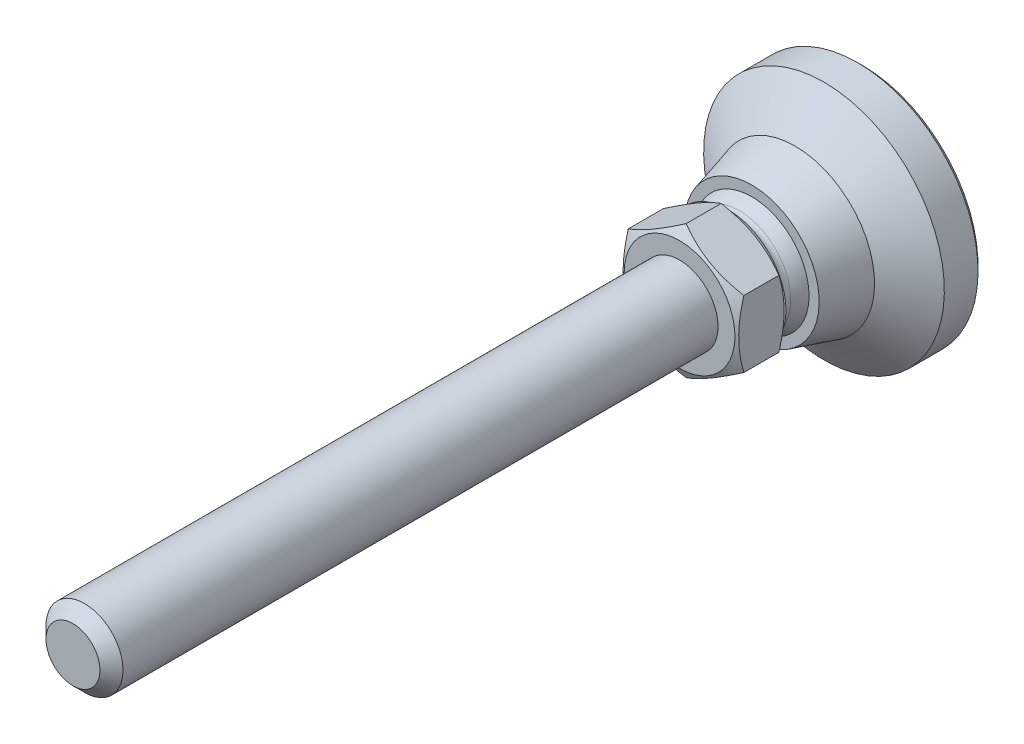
ISO-10303-21;
HEADER;
FILE_DESCRIPTION(('STEP AP214'),'2;1');
FILE_NAME('part.step','',(''),(''),'','','');
FILE_SCHEMA(('AUTOMOTIVE_DESIGN { 1 0 10303 214 1 1 1 1 }'));
ENDSEC;
DATA;
#1=APPLICATION_CONTEXT('core data for automotive mechanical design processes');
#2=APPLICATION_PROTOCOL_DEFINITION('international standard','automotive_design',2000,#1);
#3=PRODUCT_CONTEXT('',#1,'mechanical');
#4=PRODUCT('Part','Part','',(#3));
#5=PRODUCT_RELATED_PRODUCT_CATEGORY('part','',(#4));
#6=PRODUCT_DEFINITION_FORMATION('','',#4);
#7=PRODUCT_DEFINITION_CONTEXT('part definition',#1,'design');
#8=PRODUCT_DEFINITION('design','',#6,#7);
#9=PRODUCT_DEFINITION_SHAPE('','',#8);
#10=(LENGTH_UNIT() NAMED_UNIT(*) SI_UNIT(.MILLI.,.METRE.));
#11=(NAMED_UNIT(*) PLANE_ANGLE_UNIT() SI_UNIT($,.RADIAN.));
#12=(NAMED_UNIT(*) SI_UNIT($,.STERADIAN.) SOLID_ANGLE_UNIT());
#13=UNCERTAINTY_MEASURE_WITH_UNIT(LENGTH_MEASURE(1.E-05),#10,'distance_accuracy_value','');
#14=(GEOMETRIC_REPRESENTATION_CONTEXT(3) GLOBAL_UNCERTAINTY_ASSIGNED_CONTEXT((#13)) GLOBAL_UNIT_ASSIGNED_CONTEXT((#10,
#11,#12)) REPRESENTATION_CONTEXT('',''));
#15=CARTESIAN_POINT('',(0.,0.,0.));
#16=DIRECTION('',(0.,0.,1.));
#17=DIRECTION('',(1.,0.,0.));
#18=AXIS2_PLACEMENT_3D('',#15,#16,#17);
#19=CARTESIAN_POINT('',(0.,0.,0.5));
#20=DIRECTION('',(0.,0.,1.));
#21=DIRECTION('',(0.,-1.,0.));
#22=AXIS2_PLACEMENT_3D('',#19,#20,#21);
#23=CONICAL_SURFACE('',#22,12.5,0.785398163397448);
#24=CARTESIAN_POINT('',(0.,0.,0.));
#25=DIRECTION('',(0.,0.,-1.));
#26=DIRECTION('',(0.,1.,0.));
#27=AXIS2_PLACEMENT_3D('',#24,#25,#26);
#28=CIRCLE('',#27,12.);
#29=CARTESIAN_POINT('',(0.,12.,0.));
#30=VERTEX_POINT('',#29);
#31=EDGE_CURVE('E109',#30,#30,#28,.T.);
#32=ORIENTED_EDGE('',*,*,#31,.F.);
#33=EDGE_LOOP('',(#32));
#34=FACE_BOUND('',#33,.T.);
#35=CARTESIAN_POINT('',(0.,0.,0.5));
#36=DIRECTION('',(0.,0.,-1.));
#37=DIRECTION('',(0.,1.,0.));
#38=AXIS2_PLACEMENT_3D('',#35,#36,#37);
#39=CIRCLE('',#38,12.5);
#40=CARTESIAN_POINT('',(0.,12.5,0.5));
#41=VERTEX_POINT('',#40);
#42=EDGE_CURVE('E144',#41,#41,#39,.T.);
#43=ORIENTED_EDGE('',*,*,#42,.T.);
#44=EDGE_LOOP('',(#43));
#45=FACE_BOUND('',#44,.T.);
#46=ADVANCED_FACE('F14',(#34,#45),#23,.T.);
#47=CARTESIAN_POINT('',(0.,0.,0.));
#48=DIRECTION('',(0.,0.,1.));
#49=DIRECTION('',(0.,-1.,0.));
#50=AXIS2_PLACEMENT_3D('',#47,#48,#49);
#51=PLANE('',#50);
#52=ORIENTED_EDGE('',*,*,#31,.T.);
#53=EDGE_LOOP('',(#52));
#54=FACE_BOUND('',#53,.T.);
#55=ADVANCED_FACE('F283',(#54),#51,.F.);
#56=CARTESIAN_POINT('',(0.,0.,13.1997728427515));
#57=DIRECTION('',(0.,0.,-1.));
#58=DIRECTION('',(0.,1.,0.));
#59=AXIS2_PLACEMENT_3D('',#56,#57,#58);
#60=TOROIDAL_SURFACE('',#59,6.05010572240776,0.800227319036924);
#61=CARTESIAN_POINT('',(0.,0.,12.8053528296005));
#62=DIRECTION('',(0.,0.,-1.));
#63=DIRECTION('',(0.,1.,0.));
#64=AXIS2_PLACEMENT_3D('',#61,#62,#63);
#65=CIRCLE('',#64,5.35383234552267);
#66=CARTESIAN_POINT('',(-5.3538323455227,0.,12.8053528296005));
#67=VERTEX_POINT('',#66);
#68=EDGE_CURVE('E160',#67,#67,#65,.T.);
#69=ORIENTED_EDGE('',*,*,#68,.F.);
#70=EDGE_LOOP('',(#69));
#71=FACE_BOUND('',#70,.T.);
#72=CARTESIAN_POINT('',(2.32740595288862,5.58441436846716,14.0000001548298));
#73=CARTESIAN_POINT('',(2.38730882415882,5.55944918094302,14.0000001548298));
#74=CARTESIAN_POINT('',(2.44680968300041,5.53351945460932,14.0000001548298));
#75=CARTESIAN_POINT('',(2.56494646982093,5.47975932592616,14.0000001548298));
#76=CARTESIAN_POINT('',(2.62358239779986,5.45192892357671,14.0000001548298));
#77=CARTESIAN_POINT('',(2.73992841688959,5.39439584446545,14.0000001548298));
#78=CARTESIAN_POINT('',(2.79763850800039,5.36469316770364,14.0000001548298));
#79=CARTESIAN_POINT('',(2.91207314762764,5.30344640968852,14.0000001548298));
#80=CARTESIAN_POINT('',(2.96879769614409,5.2719023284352,14.0000001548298));
#81=CARTESIAN_POINT('',(3.08120249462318,5.20700538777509,14.0000001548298));
#82=CARTESIAN_POINT('',(3.13688274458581,5.1736525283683,14.0000001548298));
#83=CARTESIAN_POINT('',(3.24714131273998,5.10517260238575,14.0000001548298));
#84=CARTESIAN_POINT('',(3.3017196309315,5.07004553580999,14.0000001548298));
#85=CARTESIAN_POINT('',(3.40971774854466,4.99805346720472,14.0000001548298));
#86=CARTESIAN_POINT('',(3.46313754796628,4.96118846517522,14.0000001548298));
#87=CARTESIAN_POINT('',(3.56876357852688,4.88575907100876,14.0000001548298));
#88=CARTESIAN_POINT('',(3.62096980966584,4.8471946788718,14.0000001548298));
#89=CARTESIAN_POINT('',(3.67254173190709,4.80779986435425,14.0000001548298));
#90=B_SPLINE_CURVE_WITH_KNOTS('',3,(#72,#73,#74,#75,#76,#77,#78,#79,#80,#81,#82,#83,#84,#85,#86,
#87,#88,#89),.UNSPECIFIED.,.F.,.F.,(4,2,2,2,2,2,2,2,4),(0.,0.194682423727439,0.389364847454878,
0.584047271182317,0.778729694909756,0.973412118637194,1.16809454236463,1.36277696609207,
1.55745938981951),.UNSPECIFIED.);
#91=CARTESIAN_POINT('',(2.32724464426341,5.58455280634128,14.0000001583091));
#92=VERTEX_POINT('',#91);
#93=CARTESIAN_POINT('',(3.67274227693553,4.80772938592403,14.0000001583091));
#94=VERTEX_POINT('',#93);
#95=EDGE_CURVE('E166',#92,#94,#90,.T.);
#96=ORIENTED_EDGE('',*,*,#95,.T.);
#97=CARTESIAN_POINT('',(0.,0.,14.0000001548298));
#98=DIRECTION('',(0.,0.,-1.));
#99=DIRECTION('',(0.,1.,0.));
#100=AXIS2_PLACEMENT_3D('',#97,#98,#99);
#101=CIRCLE('',#100,6.05000019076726);
#102=CARTESIAN_POINT('',(5.99998692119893,0.776823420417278,14.0000001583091));
#103=VERTEX_POINT('',#102);
#104=EDGE_CURVE('E169',#94,#103,#101,.T.);
#105=ORIENTED_EDGE('',*,*,#104,.T.);
#106=CARTESIAN_POINT('',(5.9999476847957,0.776614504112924,14.0000001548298));
#107=CARTESIAN_POINT('',(6.00827863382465,0.712254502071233,14.0000001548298));
#108=CARTESIAN_POINT('',(6.01557326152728,0.647760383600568,14.0000001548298));
#109=CARTESIAN_POINT('',(6.02808401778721,0.51857086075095,14.0000001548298));
#110=CARTESIAN_POINT('',(6.03330014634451,0.453875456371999,14.0000001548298));
#111=CARTESIAN_POINT('',(6.04164804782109,0.324350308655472,14.0000001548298));
#112=CARTESIAN_POINT('',(6.04477982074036,0.259520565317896,14.0000001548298));
#113=CARTESIAN_POINT('',(6.04895589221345,0.129793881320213,14.0000001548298));
#114=CARTESIAN_POINT('',(6.05000019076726,0.0648969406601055,14.0000001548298));
#115=CARTESIAN_POINT('',(6.05000019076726,-0.0648969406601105,14.0000001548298));
#116=CARTESIAN_POINT('',(6.04895589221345,-0.129793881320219,14.0000001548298));
#117=CARTESIAN_POINT('',(6.04477982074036,-0.259520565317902,14.0000001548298));
#118=CARTESIAN_POINT('',(6.04164804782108,-0.324350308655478,14.0000001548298));
#119=CARTESIAN_POINT('',(6.03330014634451,-0.453875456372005,14.0000001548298));
#120=CARTESIAN_POINT('',(6.02808401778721,-0.518570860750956,14.0000001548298));
#121=CARTESIAN_POINT('',(6.01557326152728,-0.647760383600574,14.0000001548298));
#122=CARTESIAN_POINT('',(6.00827863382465,-0.712254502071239,14.0000001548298));
#123=CARTESIAN_POINT('',(5.9999476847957,-0.77661450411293,14.0000001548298));
#124=B_SPLINE_CURVE_WITH_KNOTS('',3,(#106,#107,#108,#109,#110,#111,#112,#113,#114,#115,#116,
#117,#118,#119,#120,#121,#122,#123),.UNSPECIFIED.,.F.,.F.,(4,2,2,2,2,2,2,2,4),(0.,
0.194682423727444,0.389364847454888,0.584047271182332,0.778729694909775,0.97341211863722,
1.16809454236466,1.36277696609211,1.55745938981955),.UNSPECIFIED.);
#125=CARTESIAN_POINT('',(5.99998692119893,-0.776823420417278,14.0000001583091));
#126=VERTEX_POINT('',#125);
#127=EDGE_CURVE('E615',#103,#126,#124,.T.);
#128=ORIENTED_EDGE('',*,*,#127,.T.);
#129=CARTESIAN_POINT('',(3.67274227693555,-4.80772938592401,14.0000001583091));
#130=VERTEX_POINT('',#129);
#131=EDGE_CURVE('E179',#126,#130,#101,.T.);
#132=ORIENTED_EDGE('',*,*,#131,.T.);
#133=CARTESIAN_POINT('',(3.67254173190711,-4.80779986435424,14.0000001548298));
#134=CARTESIAN_POINT('',(3.62096980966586,-4.84719467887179,14.0000001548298));
#135=CARTESIAN_POINT('',(3.56876357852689,-4.88575907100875,14.0000001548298));
#136=CARTESIAN_POINT('',(3.4631375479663,-4.96118846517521,14.0000001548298));
#137=CARTESIAN_POINT('',(3.40971774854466,-4.99805346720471,14.0000001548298));
#138=CARTESIAN_POINT('',(3.30171963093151,-5.07004553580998,14.0000001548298));
#139=CARTESIAN_POINT('',(3.24714131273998,-5.10517260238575,14.0000001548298));
#140=CARTESIAN_POINT('',(3.13688274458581,-5.1736525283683,14.0000001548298));
#141=CARTESIAN_POINT('',(3.08120249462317,-5.2070053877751,14.0000001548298));
#142=CARTESIAN_POINT('',(2.96879769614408,-5.2719023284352,14.0000001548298));
#143=CARTESIAN_POINT('',(2.91207314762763,-5.30344640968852,14.0000001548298));
#144=CARTESIAN_POINT('',(2.79763850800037,-5.36469316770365,14.0000001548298));
#145=CARTESIAN_POINT('',(2.73992841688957,-5.39439584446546,14.0000001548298));
#146=CARTESIAN_POINT('',(2.62358239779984,-5.45192892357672,14.0000001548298));
#147=CARTESIAN_POINT('',(2.56494646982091,-5.47975932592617,14.0000001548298));
#148=CARTESIAN_POINT('',(2.44680968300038,-5.53351945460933,14.0000001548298));
#149=CARTESIAN_POINT('',(2.38730882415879,-5.55944918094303,14.0000001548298));
#150=CARTESIAN_POINT('',(2.32740595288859,-5.58441436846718,14.0000001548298));
#151=B_SPLINE_CURVE_WITH_KNOTS('',3,(#133,#134,#135,#136,#137,#138,#139,#140,#141,#142,#143,
#144,#145,#146,#147,#148,#149,#150),.UNSPECIFIED.,.F.,.F.,(4,2,2,2,2,2,2,2,4),(0.,
0.194682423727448,0.389364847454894,0.58404727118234,0.778729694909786,0.973412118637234,
1.16809454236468,1.36277696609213,1.55745938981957),.UNSPECIFIED.);
#152=CARTESIAN_POINT('',(2.32724464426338,-5.58455280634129,14.0000001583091));
#153=VERTEX_POINT('',#152);
#154=EDGE_CURVE('E263',#130,#153,#151,.T.);
#155=ORIENTED_EDGE('',*,*,#154,.T.);
#156=CARTESIAN_POINT('',(-2.32724464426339,-5.58455280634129,14.0000001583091));
#157=VERTEX_POINT('',#156);
#158=EDGE_CURVE('E181',#153,#157,#101,.T.);
#159=ORIENTED_EDGE('',*,*,#158,.T.);
#160=CARTESIAN_POINT('',(-2.32740595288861,-5.58441436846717,14.0000001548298));
#161=CARTESIAN_POINT('',(-2.38730882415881,-5.55944918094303,14.0000001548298));
#162=CARTESIAN_POINT('',(-2.4468096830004,-5.53351945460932,14.0000001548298));
#163=CARTESIAN_POINT('',(-2.56494646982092,-5.47975932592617,14.0000001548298));
#164=CARTESIAN_POINT('',(-2.62358239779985,-5.45192892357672,14.0000001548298));
#165=CARTESIAN_POINT('',(-2.73992841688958,-5.39439584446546,14.0000001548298));
#166=CARTESIAN_POINT('',(-2.79763850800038,-5.36469316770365,14.0000001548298));
#167=CARTESIAN_POINT('',(-2.91207314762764,-5.30344640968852,14.0000001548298));
#168=CARTESIAN_POINT('',(-2.96879769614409,-5.2719023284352,14.0000001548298));
#169=CARTESIAN_POINT('',(-3.08120249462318,-5.20700538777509,14.0000001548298));
#170=CARTESIAN_POINT('',(-3.13688274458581,-5.1736525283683,14.0000001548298));
#171=CARTESIAN_POINT('',(-3.24714131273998,-5.10517260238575,14.0000001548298));
#172=CARTESIAN_POINT('',(-3.30171963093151,-5.07004553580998,14.0000001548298));
#173=CARTESIAN_POINT('',(-3.40971774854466,-4.99805346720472,14.0000001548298));
#174=CARTESIAN_POINT('',(-3.46313754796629,-4.96118846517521,14.0000001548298));
#175=CARTESIAN_POINT('',(-3.56876357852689,-4.88575907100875,14.0000001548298));
#176=CARTESIAN_POINT('',(-3.62096980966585,-4.84719467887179,14.0000001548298));
#177=CARTESIAN_POINT('',(-3.6725417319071,-4.80779986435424,14.0000001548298));
#178=B_SPLINE_CURVE_WITH_KNOTS('',3,(#160,#161,#162,#163,#164,#165,#166,#167,#168,#169,#170,
#171,#172,#173,#174,#175,#176,#177),.UNSPECIFIED.,.F.,.F.,(4,2,2,2,2,2,2,2,4),(0.,
0.194682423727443,0.389364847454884,0.58404727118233,0.77872969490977,0.973412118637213,
1.16809454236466,1.3627769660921,1.55745938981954),.UNSPECIFIED.);
#179=CARTESIAN_POINT('',(-3.67274227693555,-4.80772938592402,14.0000001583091));
#180=VERTEX_POINT('',#179);
#181=EDGE_CURVE('E148',#157,#180,#178,.T.);
#182=ORIENTED_EDGE('',*,*,#181,.T.);
#183=CARTESIAN_POINT('',(-5.99999019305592,-0.776824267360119,14.0000001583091));
#184=VERTEX_POINT('',#183);
#185=EDGE_CURVE('E183',#180,#184,#101,.T.);
#186=ORIENTED_EDGE('',*,*,#185,.T.);
#187=CARTESIAN_POINT('',(-5.99994768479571,-0.776614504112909,14.0000001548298));
#188=CARTESIAN_POINT('',(-6.00827863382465,-0.71225450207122,14.0000001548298));
#189=CARTESIAN_POINT('',(-6.01557326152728,-0.647760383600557,14.0000001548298));
#190=CARTESIAN_POINT('',(-6.02808401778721,-0.518570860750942,14.0000001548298));
#191=CARTESIAN_POINT('',(-6.03330014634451,-0.45387545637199,14.0000001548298));
#192=CARTESIAN_POINT('',(-6.04164804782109,-0.324350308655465,14.0000001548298));
#193=CARTESIAN_POINT('',(-6.04477982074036,-0.259520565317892,14.0000001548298));
#194=CARTESIAN_POINT('',(-6.04895589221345,-0.129793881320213,14.0000001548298));
#195=CARTESIAN_POINT('',(-6.05000019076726,-0.0648969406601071,14.0000001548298));
#196=CARTESIAN_POINT('',(-6.05000019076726,0.0648969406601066,14.0000001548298));
#197=CARTESIAN_POINT('',(-6.04895589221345,0.129793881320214,14.0000001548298));
#198=CARTESIAN_POINT('',(-6.04477982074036,0.259520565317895,14.0000001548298));
#199=CARTESIAN_POINT('',(-6.04164804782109,0.324350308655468,14.0000001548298));
#200=CARTESIAN_POINT('',(-6.03330014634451,0.453875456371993,14.0000001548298));
#201=CARTESIAN_POINT('',(-6.02808401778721,0.518570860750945,14.0000001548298));
#202=CARTESIAN_POINT('',(-6.01557326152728,0.64776038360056,14.0000001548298));
#203=CARTESIAN_POINT('',(-6.00827863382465,0.712254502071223,14.0000001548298));
#204=CARTESIAN_POINT('',(-5.99994768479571,0.776614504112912,14.0000001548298));
#205=B_SPLINE_CURVE_WITH_KNOTS('',3,(#187,#188,#189,#190,#191,#192,#193,#194,#195,#196,#197,
#198,#199,#200,#201,#202,#203,#204),.UNSPECIFIED.,.F.,.F.,(4,2,2,2,2,2,2,2,4),(0.,
0.194682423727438,0.389364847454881,0.584047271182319,0.778729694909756,0.9734121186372,
1.16809454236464,1.36277696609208,1.55745938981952),.UNSPECIFIED.);
#206=CARTESIAN_POINT('',(-5.99998692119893,0.77682342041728,14.0000001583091));
#207=VERTEX_POINT('',#206);
#208=EDGE_CURVE('E121',#184,#207,#205,.T.);
#209=ORIENTED_EDGE('',*,*,#208,.T.);
#210=CARTESIAN_POINT('',(-3.67274464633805,4.80773179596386,14.0000001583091));
#211=VERTEX_POINT('',#210);
#212=EDGE_CURVE('E185',#207,#211,#101,.T.);
#213=ORIENTED_EDGE('',*,*,#212,.T.);
#214=CARTESIAN_POINT('',(-3.67254173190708,4.80779986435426,14.0000001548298));
#215=CARTESIAN_POINT('',(-3.62096980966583,4.84719467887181,14.0000001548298));
#216=CARTESIAN_POINT('',(-3.56876357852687,4.88575907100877,14.0000001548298));
#217=CARTESIAN_POINT('',(-3.46313754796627,4.96118846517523,14.0000001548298));
#218=CARTESIAN_POINT('',(-3.40971774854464,4.99805346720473,14.0000001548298));
#219=CARTESIAN_POINT('',(-3.30171963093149,5.07004553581,14.0000001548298));
#220=CARTESIAN_POINT('',(-3.24714131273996,5.10517260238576,14.0000001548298));
#221=CARTESIAN_POINT('',(-3.1368827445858,5.17365252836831,14.0000001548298));
#222=CARTESIAN_POINT('',(-3.08120249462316,5.2070053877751,14.0000001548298));
#223=CARTESIAN_POINT('',(-2.96879769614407,5.27190232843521,14.0000001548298));
#224=CARTESIAN_POINT('',(-2.91207314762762,5.30344640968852,14.0000001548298));
#225=CARTESIAN_POINT('',(-2.79763850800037,5.36469316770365,14.0000001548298));
#226=CARTESIAN_POINT('',(-2.73992841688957,5.39439584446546,14.0000001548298));
#227=CARTESIAN_POINT('',(-2.62358239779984,5.45192892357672,14.0000001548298));
#228=CARTESIAN_POINT('',(-2.56494646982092,5.47975932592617,14.0000001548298));
#229=CARTESIAN_POINT('',(-2.44680968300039,5.53351945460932,14.0000001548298));
#230=CARTESIAN_POINT('',(-2.3873088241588,5.55944918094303,14.0000001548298));
#231=CARTESIAN_POINT('',(-2.3274059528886,5.58441436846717,14.0000001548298));
#232=B_SPLINE_CURVE_WITH_KNOTS('',3,(#214,#215,#216,#217,#218,#219,#220,#221,#222,#223,#224,
#225,#226,#227,#228,#229,#230,#231),.UNSPECIFIED.,.F.,.F.,(4,2,2,2,2,2,2,2,4),(0.,
0.194682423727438,0.389364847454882,0.584047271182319,0.778729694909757,0.9734121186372,
1.16809454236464,1.36277696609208,1.55745938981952),.UNSPECIFIED.);
#233=CARTESIAN_POINT('',(-2.32724464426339,5.58455280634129,14.0000001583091));
#234=VERTEX_POINT('',#233);
#235=EDGE_CURVE('E124',#211,#234,#232,.T.);
#236=ORIENTED_EDGE('',*,*,#235,.T.);
#237=EDGE_CURVE('E163',#234,#92,#101,.T.);
#238=ORIENTED_EDGE('',*,*,#237,.T.);
#239=EDGE_LOOP('',(#96,#105,#128,#132,#155,#159,#182,#186,#209,#213,#236,#238));
#240=FACE_BOUND('',#239,.T.);
#241=ADVANCED_FACE('F191',(#71,#240),#60,.F.);
#242=CARTESIAN_POINT('',(0.,0.,9.580608));
#243=DIRECTION('',(0.,0.,-1.));
#244=DIRECTION('',(-1.,0.,0.));
#245=AXIS2_PLACEMENT_3D('',#242,#243,#244);
#246=SPHERICAL_SURFACE('',#245,6.25);
#247=CARTESIAN_POINT('',(0.,0.,11.5000001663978));
#248=DIRECTION('',(0.,0.,-1.));
#249=DIRECTION('',(0.,1.,0.));
#250=AXIS2_PLACEMENT_3D('',#247,#248,#249);
#251=CIRCLE('',#250,5.94797727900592);
#252=CARTESIAN_POINT('',(-5.94797727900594,0.,11.5000001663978));
#253=VERTEX_POINT('',#252);
#254=EDGE_CURVE('E157',#253,#253,#251,.T.);
#255=CARTESIAN_POINT('',(-5.94797727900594,0.,11.5000001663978));
#256=CARTESIAN_POINT('',(-5.94337913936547,0.,11.5142492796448));
#257=CARTESIAN_POINT('',(-5.93872979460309,0.,11.528481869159));
#258=CARTESIAN_POINT('',(-5.92932893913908,0.,11.5569132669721));
#259=CARTESIAN_POINT('',(-5.92457742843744,0.,11.5711120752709));
#260=CARTESIAN_POINT('',(-5.91497248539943,0.,11.5994751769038));
#261=CARTESIAN_POINT('',(-5.91011905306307,0.,11.6136394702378));
#262=CARTESIAN_POINT('',(-5.90031051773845,0.,11.6419328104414));
#263=CARTESIAN_POINT('',(-5.89535541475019,0.,11.6560618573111));
#264=CARTESIAN_POINT('',(-5.88534379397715,0.,11.6842839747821));
#265=CARTESIAN_POINT('',(-5.88028727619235,0.,11.6983770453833));
#266=CARTESIAN_POINT('',(-5.87007308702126,0.,11.7265264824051));
#267=CARTESIAN_POINT('',(-5.86491541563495,0.,11.7405828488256));
#268=CARTESIAN_POINT('',(-5.85449918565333,0.,11.7686581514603));
#269=CARTESIAN_POINT('',(-5.84924062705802,0.,11.7826770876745));
#270=CARTESIAN_POINT('',(-5.83862289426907,0.,11.8106768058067));
#271=CARTESIAN_POINT('',(-5.83326372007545,0.,11.8246575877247));
#272=CARTESIAN_POINT('',(-5.82244503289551,0.,11.8525802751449));
#273=CARTESIAN_POINT('',(-5.81698551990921,0.,11.866522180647));
#274=CARTESIAN_POINT('',(-5.80596643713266,0.,11.8943663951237));
#275=CARTESIAN_POINT('',(-5.80040686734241,0.,11.9082687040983));
#276=CARTESIAN_POINT('',(-5.78918795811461,0.,11.9360330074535));
#277=CARTESIAN_POINT('',(-5.78352861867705,0.,11.9498950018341));
#278=CARTESIAN_POINT('',(-5.77211046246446,0.,11.9775779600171));
#279=CARTESIAN_POINT('',(-5.76635164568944,0.,11.9913989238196));
#280=CARTESIAN_POINT('',(-5.75473483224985,0.,12.0189991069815));
#281=CARTESIAN_POINT('',(-5.7488768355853,0.,12.0327783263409));
#282=CARTESIAN_POINT('',(-5.73706196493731,0.,12.060294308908));
#283=CARTESIAN_POINT('',(-5.73110509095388,0.,12.0740310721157));
#284=CARTESIAN_POINT('',(-5.71909277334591,0.,12.1014614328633));
#285=CARTESIAN_POINT('',(-5.71303732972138,0.,12.1151550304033));
#286=CARTESIAN_POINT('',(-5.70082818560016,0.,12.1424983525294));
#287=CARTESIAN_POINT('',(-5.69467448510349,0.,12.1561480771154));
#288=CARTESIAN_POINT('',(-5.68226914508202,0.,12.1834029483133));
#289=CARTESIAN_POINT('',(-5.67601750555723,0.,12.1970080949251));
#290=CARTESIAN_POINT('',(-5.6634166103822,0.,12.2241731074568));
#291=CARTESIAN_POINT('',(-5.65706735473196,0.,12.2377329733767));
#292=CARTESIAN_POINT('',(-5.64427155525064,0.,12.2648067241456));
#293=CARTESIAN_POINT('',(-5.63782501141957,0.,12.2783206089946));
#294=CARTESIAN_POINT('',(-5.62483496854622,0.,12.3053016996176));
#295=CARTESIAN_POINT('',(-5.61829146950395,0.,12.3187689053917));
#296=CARTESIAN_POINT('',(-5.60510785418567,0.,12.345655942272));
#297=CARTESIAN_POINT('',(-5.59846773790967,0.,12.3590757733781));
#298=CARTESIAN_POINT('',(-5.58509123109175,0.,12.3858673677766));
#299=CARTESIAN_POINT('',(-5.57835484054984,0.,12.3992391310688));
#300=CARTESIAN_POINT('',(-5.56478613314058,0.,12.4259338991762));
#301=CARTESIAN_POINT('',(-5.55795381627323,0.,12.4392569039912));
#302=CARTESIAN_POINT('',(-5.54419360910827,0.,12.4658534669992));
#303=CARTESIAN_POINT('',(-5.53726571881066,0.,12.4791270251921));
#304=CARTESIAN_POINT('',(-5.5233147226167,0.,12.505624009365));
#305=CARTESIAN_POINT('',(-5.51629161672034,0.,12.5188474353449));
#306=CARTESIAN_POINT('',(-5.50215055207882,0.,12.5452434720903));
#307=CARTESIAN_POINT('',(-5.49503259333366,0.,12.5584160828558));
#308=CARTESIAN_POINT('',(-5.48070219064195,0.,12.5847098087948));
#309=CARTESIAN_POINT('',(-5.4734897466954,0.,12.5978309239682));
#310=CARTESIAN_POINT('',(-5.45897074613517,0.,12.624020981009));
#311=CARTESIAN_POINT('',(-5.45166418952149,0.,12.6370899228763));
#312=CARTESIAN_POINT('',(-5.43695734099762,0.,12.663174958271));
#313=CARTESIAN_POINT('',(-5.42955704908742,0.,12.6761910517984));
#314=CARTESIAN_POINT('',(-5.41466311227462,0.,12.7021697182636));
#315=CARTESIAN_POINT('',(-5.40716946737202,0.,12.7151322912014));
#316=CARTESIAN_POINT('',(-5.39208921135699,0.,12.7410032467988));
#317=CARTESIAN_POINT('',(-5.38450260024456,0.,12.7539116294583));
#318=CARTESIAN_POINT('',(-5.36923680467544,0.,12.7796735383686));
#319=CARTESIAN_POINT('',(-5.36155762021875,0.,12.7925270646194));
#320=CARTESIAN_POINT('',(-5.3538323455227,0.,12.8053528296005));
#321=B_SPLINE_CURVE_WITH_KNOTS('',3,(#255,#256,#257,#258,#259,#260,#261,#262,#263,#264,#265,
#266,#267,#268,#269,#270,#271,#272,#273,#274,#275,#276,#277,#278,#279,#280,#281,#282,#283,#284,
#285,#286,#287,#288,#289,#290,#291,#292,#293,#294,#295,#296,#297,#298,#299,#300,#301,#302,#303,
#304,#305,#306,#307,#308,#309,#310,#311,#312,#313,#314,#315,#316,#317,#318,#319,#320),
.UNSPECIFIED.,.F.,.F.,(4,2,2,2,2,2,2,2,2,2,2,2,2,2,2,2,2,2,2,2,2,2,2,2,2,2,2,2,2,2,2,2,4),(0.,
0.0449178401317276,0.0898356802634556,0.134753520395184,0.179671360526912,0.224589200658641,
0.269507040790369,0.314424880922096,0.359342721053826,0.404260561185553,0.449178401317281,
0.49409624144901,0.539014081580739,0.583931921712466,0.628849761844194,0.673767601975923,
0.718685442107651,0.763603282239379,0.808521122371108,0.853438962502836,0.898356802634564,
0.943274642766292,0.98819248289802,1.03311032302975,1.07802816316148,1.12294600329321,
1.16786384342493,1.21278168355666,1.25769952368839,1.30261736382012,1.34753520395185,
1.39245304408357,1.4373708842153),.UNSPECIFIED.);
#322=EDGE_CURVE('BSEAM282',#253,#67,#321,.T.);
#323=ORIENTED_EDGE('',*,*,#254,.F.);
#324=ORIENTED_EDGE('',*,*,#68,.T.);
#325=ORIENTED_EDGE('',*,*,#322,.T.);
#326=ORIENTED_EDGE('',*,*,#322,.F.);
#327=EDGE_LOOP('',(#323,#325,#324,#326));
#328=FACE_BOUND('',#327,.T.);
#329=ADVANCED_FACE('F282',(#328),#246,.T.);
#330=CARTESIAN_POINT('',(-6.35,0.,11.5));
#331=DIRECTION('',(0.,0.,-1.));
#332=DIRECTION('',(0.,1.,0.));
#333=AXIS2_PLACEMENT_3D('',#330,#331,#332);
#334=PLANE('',#333);
#335=CARTESIAN_POINT('',(0.,0.,11.5));
#336=DIRECTION('',(0.,0.,-1.));
#337=DIRECTION('',(0.,1.,0.));
#338=AXIS2_PLACEMENT_3D('',#335,#336,#337);
#339=CIRCLE('',#338,7.);
#340=CARTESIAN_POINT('',(0.,7.,11.5));
#341=VERTEX_POINT('',#340);
#342=EDGE_CURVE('E154',#341,#341,#339,.T.);
#343=ORIENTED_EDGE('',*,*,#342,.F.);
#344=EDGE_LOOP('',(#343));
#345=FACE_BOUND('',#344,.T.);
#346=ORIENTED_EDGE('',*,*,#254,.T.);
#347=EDGE_LOOP('',(#346));
#348=FACE_BOUND('',#347,.T.);
#349=ADVANCED_FACE('F445',(#345,#348),#334,.F.);
#350=CARTESIAN_POINT('',(0.,0.,11.5));
#351=DIRECTION('',(0.,0.,-1.));
#352=DIRECTION('',(0.,1.,0.));
#353=AXIS2_PLACEMENT_3D('',#350,#351,#352);
#354=CONICAL_SURFACE('',#353,7.,0.270946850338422);
#355=CARTESIAN_POINT('',(0.,0.,7.));
#356=DIRECTION('',(0.,0.,-1.));
#357=DIRECTION('',(0.,1.,0.));
#358=AXIS2_PLACEMENT_3D('',#355,#356,#357);
#359=CIRCLE('',#358,8.25);
#360=CARTESIAN_POINT('',(0.,8.25,7.));
#361=VERTEX_POINT('',#360);
#362=EDGE_CURVE('E151',#361,#361,#359,.T.);
#363=ORIENTED_EDGE('',*,*,#362,.F.);
#364=EDGE_LOOP('',(#363));
#365=FACE_BOUND('',#364,.T.);
#366=ORIENTED_EDGE('',*,*,#342,.T.);
#367=EDGE_LOOP('',(#366));
#368=FACE_BOUND('',#367,.T.);
#369=ADVANCED_FACE('F440',(#365,#368),#354,.T.);
#370=CARTESIAN_POINT('',(0.,0.,7.));
#371=DIRECTION('',(0.,0.,-1.));
#372=DIRECTION('',(0.,1.,0.));
#373=AXIS2_PLACEMENT_3D('',#370,#371,#372);
#374=CONICAL_SURFACE('',#373,8.25,0.956133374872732);
#375=CARTESIAN_POINT('',(0.,0.,4.));
#376=DIRECTION('',(0.,0.,-1.));
#377=DIRECTION('',(0.,1.,0.));
#378=AXIS2_PLACEMENT_3D('',#375,#376,#377);
#379=CIRCLE('',#378,12.5);
#380=CARTESIAN_POINT('',(0.,12.5,4.));
#381=VERTEX_POINT('',#380);
#382=EDGE_CURVE('E147',#381,#381,#379,.T.);
#383=ORIENTED_EDGE('',*,*,#382,.F.);
#384=EDGE_LOOP('',(#383));
#385=FACE_BOUND('',#384,.T.);
#386=ORIENTED_EDGE('',*,*,#362,.T.);
#387=EDGE_LOOP('',(#386));
#388=FACE_BOUND('',#387,.T.);
#389=ADVANCED_FACE('F435',(#385,#388),#374,.T.);
#390=CARTESIAN_POINT('',(0.,0.,0.));
#391=DIRECTION('',(0.,0.,-1.));
#392=DIRECTION('',(0.,1.,0.));
#393=AXIS2_PLACEMENT_3D('',#390,#391,#392);
#394=CYLINDRICAL_SURFACE('',#393,12.5);
#395=ORIENTED_EDGE('',*,*,#42,.F.);
#396=EDGE_LOOP('',(#395));
#397=FACE_BOUND('',#396,.T.);
#398=ORIENTED_EDGE('',*,*,#382,.T.);
#399=EDGE_LOOP('',(#398));
#400=FACE_BOUND('',#399,.T.);
#401=ADVANCED_FACE('F219',(#397,#400),#394,.T.);
#402=CARTESIAN_POINT('',(0.,5.75,14.0000001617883));
#403=DIRECTION('',(0.,0.,-1.));
#404=DIRECTION('',(-1.,0.,0.));
#405=AXIS2_PLACEMENT_3D('',#402,#403,#404);
#406=PLANE('',#405);
#407=ORIENTED_EDGE('',*,*,#181,.F.);
#408=ORIENTED_EDGE('',*,*,#158,.F.);
#409=ORIENTED_EDGE('',*,*,#154,.F.);
#410=ORIENTED_EDGE('',*,*,#131,.F.);
#411=ORIENTED_EDGE('',*,*,#127,.F.);
#412=ORIENTED_EDGE('',*,*,#104,.F.);
#413=ORIENTED_EDGE('',*,*,#95,.F.);
#414=ORIENTED_EDGE('',*,*,#237,.F.);
#415=ORIENTED_EDGE('',*,*,#235,.F.);
#416=ORIENTED_EDGE('',*,*,#212,.F.);
#417=ORIENTED_EDGE('',*,*,#208,.F.);
#418=ORIENTED_EDGE('',*,*,#185,.F.);
#419=EDGE_LOOP('',(#407,#408,#409,#410,#411,#412,#413,#414,#415,#416,#417,#418));
#420=FACE_BOUND('',#419,.T.);
#421=CARTESIAN_POINT('',(0.,0.,14.0000001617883));
#422=DIRECTION('',(0.,0.,-1.));
#423=DIRECTION('',(-1.,0.,0.));
#424=AXIS2_PLACEMENT_3D('',#421,#422,#423);
#425=CIRCLE('',#424,5.75);
#426=CARTESIAN_POINT('',(-5.75,0.,14.0000001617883));
#427=VERTEX_POINT('',#426);
#428=EDGE_CURVE('E115',#427,#427,#425,.T.);
#429=ORIENTED_EDGE('',*,*,#428,.T.);
#430=EDGE_LOOP('',(#429));
#431=FACE_BOUND('',#430,.T.);
#432=ADVANCED_FACE('F195',(#420,#431),#406,.F.);
#433=CARTESIAN_POINT('',(0.,0.,15.7126172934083));
#434=DIRECTION('',(0.,0.,1.));
#435=DIRECTION('',(1.,0.,0.));
#436=AXIS2_PLACEMENT_3D('',#433,#434,#435);
#437=CONICAL_SURFACE('',#436,8.71633988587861,1.0471975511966);
#438=CARTESIAN_POINT('',(-6.0002,3.46398614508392,14.6803027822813));
#439=CARTESIAN_POINT('',(-5.86831298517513,3.54013114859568,14.6363467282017));
#440=CARTESIAN_POINT('',(-5.73593423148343,3.61656005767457,14.5943855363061));
#441=CARTESIAN_POINT('',(-5.47010166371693,3.77003856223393,14.5150023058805));
#442=CARTESIAN_POINT('',(-5.3366474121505,3.84708841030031,14.4775822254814));
#443=CARTESIAN_POINT('',(-4.93414786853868,4.0794716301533,14.3728681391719));
#444=CARTESIAN_POINT('',(-4.66351376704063,4.23572230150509,14.3133077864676));
#445=CARTESIAN_POINT('',(-4.25851475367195,4.46954859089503,14.243465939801));
#446=CARTESIAN_POINT('',(-4.12535995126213,4.54642555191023,14.2235699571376));
#447=CARTESIAN_POINT('',(-3.85844867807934,4.70052684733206,14.1902071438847));
#448=CARTESIAN_POINT('',(-3.72469226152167,4.77775115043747,14.1767397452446));
#449=CARTESIAN_POINT('',(-3.45694711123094,4.93233388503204,14.1565773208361));
#450=CARTESIAN_POINT('',(-3.32295881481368,5.0096920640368,14.1498746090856));
#451=CARTESIAN_POINT('',(-3.05486583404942,5.16447561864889,14.1433780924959));
#452=CARTESIAN_POINT('',(-2.92076115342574,5.24190099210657,14.1435840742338));
#453=CARTESIAN_POINT('',(-2.55335498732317,5.45402304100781,14.1536449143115));
#454=CARTESIAN_POINT('',(-2.3201737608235,5.58865028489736,14.170535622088));
#455=CARTESIAN_POINT('',(-1.85536008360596,5.85701058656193,14.2240969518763));
#456=CARTESIAN_POINT('',(-1.6237292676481,5.99074270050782,14.2607858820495));
#457=CARTESIAN_POINT('',(-1.15798010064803,6.25964310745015,14.3524978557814));
#458=CARTESIAN_POINT('',(-0.92392052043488,6.39477746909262,14.4079094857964));
#459=CARTESIAN_POINT('',(-0.459291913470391,6.66303092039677,14.5336716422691));
#460=CARTESIAN_POINT('',(-0.228716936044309,6.79615344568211,14.6039926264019));
#461=CARTESIAN_POINT('',(0.00020000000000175,6.92831870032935,14.6803027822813));
#462=B_SPLINE_CURVE_WITH_KNOTS('',3,(#438,#439,#440,#441,#442,#443,#444,#445,#446,#447,#448,
#449,#450,#451,#452,#453,#454,#455,#456,#457,#458,#459,#460,#461),.UNSPECIFIED.,.F.,.F.,(4,2,2,
2,2,2,2,2,2,2,2,4),(0.,0.475482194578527,0.95116869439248,1.90451835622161,2.36951738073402,
2.83447530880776,3.29890435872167,3.76331906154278,4.57182194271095,5.38107376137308,
6.20827406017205,7.03385036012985),.UNSPECIFIED.);
#463=CARTESIAN_POINT('',(-6.,3.46410161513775,14.680236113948));
#464=VERTEX_POINT('',#463);
#465=CARTESIAN_POINT('',(0.,6.92820323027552,14.680236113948));
#466=VERTEX_POINT('',#465);
#467=EDGE_CURVE('E29',#464,#466,#462,.T.);
#468=ORIENTED_EDGE('',*,*,#467,.T.);
#469=CARTESIAN_POINT('',(-0.000199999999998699,6.92831870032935,14.6803027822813));
#470=CARTESIAN_POINT('',(0.131687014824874,6.85217369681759,14.6363467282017));
#471=CARTESIAN_POINT('',(0.264065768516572,6.7757447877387,14.5943855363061));
#472=CARTESIAN_POINT('',(0.529898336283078,6.62226628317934,14.5150023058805));
#473=CARTESIAN_POINT('',(0.663352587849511,6.54521643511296,14.4775822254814));
#474=CARTESIAN_POINT('',(1.06585213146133,6.31283321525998,14.3728681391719));
#475=CARTESIAN_POINT('',(1.33648623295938,6.15658254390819,14.3133077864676));
#476=CARTESIAN_POINT('',(1.74148524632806,5.92275625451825,14.243465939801));
#477=CARTESIAN_POINT('',(1.87464004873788,5.84587929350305,14.2235699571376));
#478=CARTESIAN_POINT('',(2.14155132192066,5.69177799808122,14.1902071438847));
#479=CARTESIAN_POINT('',(2.27530773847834,5.6145536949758,14.1767397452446));
#480=CARTESIAN_POINT('',(2.54305288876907,5.45997096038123,14.1565773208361));
#481=CARTESIAN_POINT('',(2.67704118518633,5.38261278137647,14.1498746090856));
#482=CARTESIAN_POINT('',(2.94513416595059,5.22782922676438,14.1433780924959));
#483=CARTESIAN_POINT('',(3.07923884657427,5.15040385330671,14.1435840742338));
#484=CARTESIAN_POINT('',(3.44664501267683,4.93828180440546,14.1536449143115));
#485=CARTESIAN_POINT('',(3.67982623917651,4.80365456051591,14.170535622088));
#486=CARTESIAN_POINT('',(4.14463991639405,4.53529425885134,14.2240969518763));
#487=CARTESIAN_POINT('',(4.37627073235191,4.40156214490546,14.2607858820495));
#488=CARTESIAN_POINT('',(4.84201989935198,4.13266173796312,14.3524978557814));
#489=CARTESIAN_POINT('',(5.07607947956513,3.99752737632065,14.4079094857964));
#490=CARTESIAN_POINT('',(5.54070808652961,3.72927392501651,14.5336716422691));
#491=CARTESIAN_POINT('',(5.77128306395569,3.59615139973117,14.6039926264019));
#492=CARTESIAN_POINT('',(6.0002,3.46398614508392,14.6803027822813));
#493=B_SPLINE_CURVE_WITH_KNOTS('',3,(#469,#470,#471,#472,#473,#474,#475,#476,#477,#478,#479,
#480,#481,#482,#483,#484,#485,#486,#487,#488,#489,#490,#491,#492),.UNSPECIFIED.,.F.,.F.,(4,2,2,
2,2,2,2,2,2,2,2,4),(0.,0.475482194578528,0.951168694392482,1.90451835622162,2.36951738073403,
2.83447530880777,3.29890435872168,3.76331906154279,4.57182194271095,5.38107376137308,
6.20827406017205,7.03385036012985),.UNSPECIFIED.);
#494=CARTESIAN_POINT('',(6.,3.46410161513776,14.680236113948));
#495=VERTEX_POINT('',#494);
#496=EDGE_CURVE('E102',#466,#495,#493,.T.);
#497=ORIENTED_EDGE('',*,*,#496,.T.);
#498=CARTESIAN_POINT('',(6.,3.46430161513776,14.6802938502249));
#499=CARTESIAN_POINT('',(6.,3.31201186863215,14.6363381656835));
#500=CARTESIAN_POINT('',(6.,3.15915431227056,14.5943773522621));
#501=CARTESIAN_POINT('',(6.,2.85219783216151,14.5149948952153));
#502=CARTESIAN_POINT('',(6.,2.69809840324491,14.4775752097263));
#503=CARTESIAN_POINT('',(6.,2.23333279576,14.3728623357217));
#504=CARTESIAN_POINT('',(6.,1.92083203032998,14.3133028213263));
#505=CARTESIAN_POINT('',(6.,1.45318032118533,14.2434622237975));
#506=CARTESIAN_POINT('',(6.,1.29942666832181,14.2235666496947));
#507=CARTESIAN_POINT('',(6.,0.991224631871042,14.1902046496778));
#508=CARTESIAN_POINT('',(6.,0.836776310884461,14.1767376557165));
#509=CARTESIAN_POINT('',(6.,0.527611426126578,14.1565760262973));
#510=CARTESIAN_POINT('',(6.,0.372895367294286,14.1498737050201));
#511=CARTESIAN_POINT('',(6.,0.0633288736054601,14.1433779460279));
#512=CARTESIAN_POINT('',(6.,-0.0915215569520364,14.1435842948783));
#513=CARTESIAN_POINT('',(6.,-0.515760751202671,14.1536459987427));
#514=CARTESIAN_POINT('',(6.,-0.785010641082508,14.1705368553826));
#515=CARTESIAN_POINT('',(6.,-1.3217220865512,14.2240977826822));
#516=CARTESIAN_POINT('',(6.,-1.58918175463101,14.2607861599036));
#517=CARTESIAN_POINT('',(6.,-2.12697331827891,14.3524964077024));
#518=CARTESIAN_POINT('',(6.,-2.39723735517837,14.4079068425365));
#519=CARTESIAN_POINT('',(6.,-2.93373504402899,14.5336661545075));
#520=CARTESIAN_POINT('',(6.,-3.19997556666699,14.6039854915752));
#521=CARTESIAN_POINT('',(6.,-3.46430161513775,14.6802938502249));
#522=B_SPLINE_CURVE_WITH_KNOTS('',3,(#498,#499,#500,#501,#502,#503,#504,#505,#506,#507,#508,
#509,#510,#511,#512,#513,#514,#515,#516,#517,#518,#519,#520,#521),.UNSPECIFIED.,.F.,.F.,(4,2,2,
2,2,2,2,2,2,2,2,4),(0.,0.475481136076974,0.951166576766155,1.9045140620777,2.36951212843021,
2.8344690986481,3.29889720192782,3.76331095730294,4.57180014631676,5.38103822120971,
6.20822404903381,7.03378598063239),.UNSPECIFIED.);
#523=CARTESIAN_POINT('',(6.,-3.46410161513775,14.680236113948));
#524=VERTEX_POINT('',#523);
#525=EDGE_CURVE('E105',#495,#524,#522,.T.);
#526=ORIENTED_EDGE('',*,*,#525,.T.);
#527=CARTESIAN_POINT('',(6.0002,-3.46398614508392,14.6803027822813));
#528=CARTESIAN_POINT('',(5.86831298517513,-3.54013114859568,14.6363467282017));
#529=CARTESIAN_POINT('',(5.73593423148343,-3.61656005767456,14.5943855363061));
#530=CARTESIAN_POINT('',(5.47010166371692,-3.77003856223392,14.5150023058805));
#531=CARTESIAN_POINT('',(5.33664741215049,-3.8470884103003,14.4775822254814));
#532=CARTESIAN_POINT('',(4.93414786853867,-4.07947163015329,14.3728681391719));
#533=CARTESIAN_POINT('',(4.66351376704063,-4.23572230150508,14.3133077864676));
#534=CARTESIAN_POINT('',(4.25851475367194,-4.46954859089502,14.243465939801));
#535=CARTESIAN_POINT('',(4.12535995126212,-4.54642555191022,14.2235699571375));
#536=CARTESIAN_POINT('',(3.85844867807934,-4.70052684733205,14.1902071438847));
#537=CARTESIAN_POINT('',(3.72469226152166,-4.77775115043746,14.1767397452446));
#538=CARTESIAN_POINT('',(3.45694711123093,-4.93233388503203,14.1565773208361));
#539=CARTESIAN_POINT('',(3.32295881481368,-5.00969206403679,14.1498746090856));
#540=CARTESIAN_POINT('',(3.05486583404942,-5.16447561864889,14.1433780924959));
#541=CARTESIAN_POINT('',(2.92076115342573,-5.24190099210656,14.1435840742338));
#542=CARTESIAN_POINT('',(2.55335498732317,-5.45402304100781,14.1536449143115));
#543=CARTESIAN_POINT('',(2.3201737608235,-5.58865028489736,14.170535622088));
#544=CARTESIAN_POINT('',(1.85536008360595,-5.85701058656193,14.2240969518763));
#545=CARTESIAN_POINT('',(1.62372926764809,-5.99074270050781,14.2607858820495));
#546=CARTESIAN_POINT('',(1.15798010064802,-6.25964310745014,14.3524978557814));
#547=CARTESIAN_POINT('',(0.923920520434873,-6.39477746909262,14.4079094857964));
#548=CARTESIAN_POINT('',(0.459291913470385,-6.66303092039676,14.5336716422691));
#549=CARTESIAN_POINT('',(0.228716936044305,-6.7961534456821,14.6039926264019));
#550=CARTESIAN_POINT('',(-0.000200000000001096,-6.92831870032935,14.6803027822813));
#551=B_SPLINE_CURVE_WITH_KNOTS('',3,(#527,#528,#529,#530,#531,#532,#533,#534,#535,#536,#537,
#538,#539,#540,#541,#542,#543,#544,#545,#546,#547,#548,#549,#550),.UNSPECIFIED.,.F.,.F.,(4,2,2,
2,2,2,2,2,2,2,2,4),(0.,0.475482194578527,0.95116869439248,1.90451835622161,2.36951738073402,
2.83447530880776,3.29890435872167,3.76331906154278,4.57182194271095,5.38107376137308,
6.20827406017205,7.03385036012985),.UNSPECIFIED.);
#552=CARTESIAN_POINT('',(0.,-6.92820323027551,14.680236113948));
#553=VERTEX_POINT('',#552);
#554=EDGE_CURVE('E114',#524,#553,#551,.T.);
#555=ORIENTED_EDGE('',*,*,#554,.T.);
#556=CARTESIAN_POINT('',(0.000199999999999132,-6.92831870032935,14.6803027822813));
#557=CARTESIAN_POINT('',(-0.131687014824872,-6.85217369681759,14.6363467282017));
#558=CARTESIAN_POINT('',(-0.264065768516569,-6.7757447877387,14.5943855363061));
#559=CARTESIAN_POINT('',(-0.529898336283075,-6.62226628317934,14.5150023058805));
#560=CARTESIAN_POINT('',(-0.663352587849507,-6.54521643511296,14.4775822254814));
#561=CARTESIAN_POINT('',(-1.06585213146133,-6.31283321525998,14.3728681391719));
#562=CARTESIAN_POINT('',(-1.33648623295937,-6.15658254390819,14.3133077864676));
#563=CARTESIAN_POINT('',(-1.74148524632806,-5.92275625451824,14.243465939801));
#564=CARTESIAN_POINT('',(-1.87464004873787,-5.84587929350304,14.2235699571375));
#565=CARTESIAN_POINT('',(-2.14155132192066,-5.69177799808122,14.1902071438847));
#566=CARTESIAN_POINT('',(-2.27530773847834,-5.6145536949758,14.1767397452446));
#567=CARTESIAN_POINT('',(-2.54305288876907,-5.45997096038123,14.1565773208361));
#568=CARTESIAN_POINT('',(-2.67704118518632,-5.38261278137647,14.1498746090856));
#569=CARTESIAN_POINT('',(-2.94513416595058,-5.22782922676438,14.1433780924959));
#570=CARTESIAN_POINT('',(-3.07923884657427,-5.1504038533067,14.1435840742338));
#571=CARTESIAN_POINT('',(-3.44664501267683,-4.93828180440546,14.1536449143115));
#572=CARTESIAN_POINT('',(-3.6798262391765,-4.80365456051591,14.170535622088));
#573=CARTESIAN_POINT('',(-4.14463991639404,-4.53529425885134,14.2240969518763));
#574=CARTESIAN_POINT('',(-4.3762707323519,-4.40156214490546,14.2607858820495));
#575=CARTESIAN_POINT('',(-4.84201989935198,-4.13266173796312,14.3524978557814));
#576=CARTESIAN_POINT('',(-5.07607947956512,-3.99752737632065,14.4079094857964));
#577=CARTESIAN_POINT('',(-5.54070808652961,-3.7292739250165,14.5336716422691));
#578=CARTESIAN_POINT('',(-5.77128306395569,-3.59615139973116,14.6039926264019));
#579=CARTESIAN_POINT('',(-6.0002,-3.46398614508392,14.6803027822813));
#580=B_SPLINE_CURVE_WITH_KNOTS('',3,(#556,#557,#558,#559,#560,#561,#562,#563,#564,#565,#566,
#567,#568,#569,#570,#571,#572,#573,#574,#575,#576,#577,#578,#579),.UNSPECIFIED.,.F.,.F.,(4,2,2,
2,2,2,2,2,2,2,2,4),(0.,0.475482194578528,0.951168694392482,1.90451835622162,2.36951738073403,
2.83447530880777,3.29890435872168,3.76331906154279,4.57182194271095,5.38107376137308,
6.20827406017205,7.03385036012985),.UNSPECIFIED.);
#581=CARTESIAN_POINT('',(-6.,-3.46410161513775,14.680236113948));
#582=VERTEX_POINT('',#581);
#583=EDGE_CURVE('E367',#553,#582,#580,.T.);
#584=ORIENTED_EDGE('',*,*,#583,.T.);
#585=CARTESIAN_POINT('',(-6.,-3.46430161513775,14.6802938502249));
#586=CARTESIAN_POINT('',(-6.,-3.31201186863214,14.6363381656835));
#587=CARTESIAN_POINT('',(-6.,-3.15915431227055,14.5943773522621));
#588=CARTESIAN_POINT('',(-6.,-2.8521978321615,14.5149948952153));
#589=CARTESIAN_POINT('',(-6.,-2.6980984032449,14.4775752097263));
#590=CARTESIAN_POINT('',(-6.,-2.23333279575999,14.3728623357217));
#591=CARTESIAN_POINT('',(-6.,-1.92083203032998,14.3133028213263));
#592=CARTESIAN_POINT('',(-6.,-1.45318032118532,14.2434622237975));
#593=CARTESIAN_POINT('',(-6.,-1.2994266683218,14.2235666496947));
#594=CARTESIAN_POINT('',(-6.,-0.99122463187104,14.1902046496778));
#595=CARTESIAN_POINT('',(-6.,-0.836776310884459,14.1767376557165));
#596=CARTESIAN_POINT('',(-6.,-0.527611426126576,14.1565760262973));
#597=CARTESIAN_POINT('',(-6.,-0.372895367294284,14.1498737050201));
#598=CARTESIAN_POINT('',(-6.,-0.0633288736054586,14.1433779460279));
#599=CARTESIAN_POINT('',(-6.,0.0915215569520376,14.1435842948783));
#600=CARTESIAN_POINT('',(-6.,0.515760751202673,14.1536459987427));
#601=CARTESIAN_POINT('',(-6.,0.785010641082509,14.1705368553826));
#602=CARTESIAN_POINT('',(-6.,1.3217220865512,14.2240977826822));
#603=CARTESIAN_POINT('',(-6.,1.58918175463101,14.2607861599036));
#604=CARTESIAN_POINT('',(-6.,2.12697331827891,14.3524964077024));
#605=CARTESIAN_POINT('',(-6.,2.39723735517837,14.4079068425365));
#606=CARTESIAN_POINT('',(-6.,2.93373504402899,14.5336661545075));
#607=CARTESIAN_POINT('',(-6.,3.19997556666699,14.6039854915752));
#608=CARTESIAN_POINT('',(-6.,3.46430161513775,14.6802938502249));
#609=B_SPLINE_CURVE_WITH_KNOTS('',3,(#585,#586,#587,#588,#589,#590,#591,#592,#593,#594,#595,
#596,#597,#598,#599,#600,#601,#602,#603,#604,#605,#606,#607,#608),.UNSPECIFIED.,.F.,.F.,(4,2,2,
2,2,2,2,2,2,2,2,4),(0.,0.475481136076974,0.951166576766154,1.9045140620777,2.36951212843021,
2.8344690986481,3.29889720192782,3.76331095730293,4.57180014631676,5.38103822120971,
6.20822404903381,7.03378598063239),.UNSPECIFIED.);
#610=EDGE_CURVE('E372',#582,#464,#609,.T.);
#611=ORIENTED_EDGE('',*,*,#610,.T.);
#612=EDGE_LOOP('',(#468,#497,#526,#555,#584,#611));
#613=FACE_BOUND('',#612,.T.);
#614=ORIENTED_EDGE('',*,*,#428,.F.);
#615=EDGE_LOOP('',(#614));
#616=FACE_BOUND('',#615,.T.);
#617=ADVANCED_FACE('F103',(#613,#616),#437,.T.);
#618=CARTESIAN_POINT('',(-6.24953881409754,0.,19.0000001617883));
#619=DIRECTION('',(0.,0.,-1.));
#620=DIRECTION('',(0.,1.,0.));
#621=AXIS2_PLACEMENT_3D('',#618,#619,#620);
#622=PLANE('',#621);
#623=CARTESIAN_POINT('',(0.,0.,19.0000001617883));
#624=DIRECTION('',(0.,0.,-1.));
#625=DIRECTION('',(-1.,0.,0.));
#626=AXIS2_PLACEMENT_3D('',#623,#624,#625);
#627=CIRCLE('',#626,4.);
#628=CARTESIAN_POINT('',(-4.,0.,19.0000001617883));
#629=VERTEX_POINT('',#628);
#630=EDGE_CURVE('E321',#629,#629,#627,.T.);
#631=ORIENTED_EDGE('',*,*,#630,.T.);
#632=EDGE_LOOP('',(#631));
#633=FACE_BOUND('',#632,.T.);
#634=CARTESIAN_POINT('',(0.,0.,19.0000001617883));
#635=DIRECTION('',(0.,0.,-1.));
#636=DIRECTION('',(-1.,0.,0.));
#637=AXIS2_PLACEMENT_3D('',#634,#635,#636);
#638=CIRCLE('',#637,5.75);
#639=CARTESIAN_POINT('',(-5.75,0.,19.0000001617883));
#640=VERTEX_POINT('',#639);
#641=EDGE_CURVE('E337',#640,#640,#638,.T.);
#642=ORIENTED_EDGE('',*,*,#641,.F.);
#643=EDGE_LOOP('',(#642));
#644=FACE_BOUND('',#643,.T.);
#645=ADVANCED_FACE('F286',(#633,#644),#622,.F.);
#646=CARTESIAN_POINT('',(0.,0.,19.0000001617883));
#647=DIRECTION('',(0.,0.,-1.));
#648=DIRECTION('',(-1.,0.,0.));
#649=AXIS2_PLACEMENT_3D('',#646,#647,#648);
#650=CONICAL_SURFACE('',#649,5.75,1.0471975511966);
#651=CARTESIAN_POINT('',(0.000200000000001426,6.92831870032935,18.3196975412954));
#652=CARTESIAN_POINT('',(-0.131687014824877,6.8521736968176,18.363653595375));
#653=CARTESIAN_POINT('',(-0.264065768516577,6.77574478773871,18.4056147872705));
#654=CARTESIAN_POINT('',(-0.529898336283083,6.62226628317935,18.4849980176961));
#655=CARTESIAN_POINT('',(-0.663352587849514,6.54521643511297,18.5224180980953));
#656=CARTESIAN_POINT('',(-1.06585213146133,6.31283321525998,18.6271321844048));
#657=CARTESIAN_POINT('',(-1.33648623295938,6.15658254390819,18.686692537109));
#658=CARTESIAN_POINT('',(-1.74148524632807,5.92275625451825,18.7565343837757));
#659=CARTESIAN_POINT('',(-1.87464004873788,5.84587929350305,18.7764303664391));
#660=CARTESIAN_POINT('',(-2.14155132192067,5.69177799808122,18.809793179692));
#661=CARTESIAN_POINT('',(-2.27530773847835,5.61455369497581,18.8232605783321));
#662=CARTESIAN_POINT('',(-2.54305288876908,5.45997096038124,18.8434230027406));
#663=CARTESIAN_POINT('',(-2.67704118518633,5.38261278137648,18.8501257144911));
#664=CARTESIAN_POINT('',(-2.94513416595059,5.22782922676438,18.8566222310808));
#665=CARTESIAN_POINT('',(-3.07923884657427,5.15040385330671,18.8564162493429));
#666=CARTESIAN_POINT('',(-3.44664501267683,4.93828180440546,18.8463554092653));
#667=CARTESIAN_POINT('',(-3.6798262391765,4.80365456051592,18.8294647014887));
#668=CARTESIAN_POINT('',(-4.14463991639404,4.53529425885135,18.7759033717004));
#669=CARTESIAN_POINT('',(-4.3762707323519,4.40156214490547,18.7392144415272));
#670=CARTESIAN_POINT('',(-4.84201989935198,4.13266173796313,18.6475024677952));
#671=CARTESIAN_POINT('',(-5.07607947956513,3.99752737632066,18.5920908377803));
#672=CARTESIAN_POINT('',(-5.54070808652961,3.72927392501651,18.4663286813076));
#673=CARTESIAN_POINT('',(-5.77128306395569,3.59615139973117,18.3960076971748));
#674=CARTESIAN_POINT('',(-6.0002,3.46398614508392,18.3196975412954));
#675=B_SPLINE_CURVE_WITH_KNOTS('',3,(#651,#652,#653,#654,#655,#656,#657,#658,#659,#660,#661,
#662,#663,#664,#665,#666,#667,#668,#669,#670,#671,#672,#673,#674),.UNSPECIFIED.,.F.,.F.,(4,2,2,
2,2,2,2,2,2,2,2,4),(0.,0.475482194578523,0.951168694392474,1.90451835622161,2.36951738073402,
2.83447530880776,3.29890435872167,3.76331906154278,4.57182194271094,5.38107376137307,
6.20827406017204,7.03385036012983),.UNSPECIFIED.);
#676=CARTESIAN_POINT('',(0.,6.92820323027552,18.3197642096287));
#677=VERTEX_POINT('',#676);
#678=CARTESIAN_POINT('',(-6.,3.46410161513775,18.3197642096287));
#679=VERTEX_POINT('',#678);
#680=EDGE_CURVE('E128',#677,#679,#675,.T.);
#681=ORIENTED_EDGE('',*,*,#680,.T.);
#682=CARTESIAN_POINT('',(-6.,3.46430161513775,18.3197064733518));
#683=CARTESIAN_POINT('',(-6.,3.31201186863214,18.3636621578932));
#684=CARTESIAN_POINT('',(-6.,3.15915431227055,18.4056229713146));
#685=CARTESIAN_POINT('',(-6.,2.8521978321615,18.4850054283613));
#686=CARTESIAN_POINT('',(-6.,2.6980984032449,18.5224251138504));
#687=CARTESIAN_POINT('',(-6.,2.23333279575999,18.6271379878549));
#688=CARTESIAN_POINT('',(-6.,1.92083203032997,18.6866975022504));
#689=CARTESIAN_POINT('',(-6.,1.45318032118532,18.7565380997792));
#690=CARTESIAN_POINT('',(-6.,1.2994266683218,18.776433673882));
#691=CARTESIAN_POINT('',(-6.,0.991224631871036,18.8097956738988));
#692=CARTESIAN_POINT('',(-6.,0.836776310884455,18.8232626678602));
#693=CARTESIAN_POINT('',(-6.,0.527611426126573,18.8434242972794));
#694=CARTESIAN_POINT('',(-6.,0.372895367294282,18.8501266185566));
#695=CARTESIAN_POINT('',(-6.,0.0633288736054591,18.8566223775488));
#696=CARTESIAN_POINT('',(-6.,-0.091521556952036,18.8564160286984));
#697=CARTESIAN_POINT('',(-6.,-0.515760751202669,18.846354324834));
#698=CARTESIAN_POINT('',(-6.,-0.785010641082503,18.829463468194));
#699=CARTESIAN_POINT('',(-6.,-1.32172208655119,18.7759025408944));
#700=CARTESIAN_POINT('',(-6.,-1.58918175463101,18.7392141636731));
#701=CARTESIAN_POINT('',(-6.,-2.1269733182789,18.6475039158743));
#702=CARTESIAN_POINT('',(-6.,-2.39723735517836,18.5920934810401));
#703=CARTESIAN_POINT('',(-6.,-2.93373504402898,18.4663341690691));
#704=CARTESIAN_POINT('',(-6.,-3.19997556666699,18.3960148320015));
#705=CARTESIAN_POINT('',(-6.,-3.46430161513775,18.3197064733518));
#706=B_SPLINE_CURVE_WITH_KNOTS('',3,(#682,#683,#684,#685,#686,#687,#688,#689,#690,#691,#692,
#693,#694,#695,#696,#697,#698,#699,#700,#701,#702,#703,#704,#705),.UNSPECIFIED.,.F.,.F.,(4,2,2,
2,2,2,2,2,2,2,2,4),(0.,0.475481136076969,0.951166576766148,1.90451406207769,2.3695121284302,
2.83446909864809,3.29889720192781,3.76331095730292,4.57180014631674,5.38103822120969,
6.2082240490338,7.03378598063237),.UNSPECIFIED.);
#707=CARTESIAN_POINT('',(-6.,-3.46410161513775,18.3197642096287));
#708=VERTEX_POINT('',#707);
#709=EDGE_CURVE('E390',#679,#708,#706,.T.);
#710=ORIENTED_EDGE('',*,*,#709,.T.);
#711=CARTESIAN_POINT('',(-6.0002,-3.46398614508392,18.3196975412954));
#712=CARTESIAN_POINT('',(-5.86831298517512,-3.54013114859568,18.363653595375));
#713=CARTESIAN_POINT('',(-5.73593423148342,-3.61656005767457,18.4056147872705));
#714=CARTESIAN_POINT('',(-5.47010166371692,-3.77003856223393,18.4849980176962));
#715=CARTESIAN_POINT('',(-5.33664741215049,-3.84708841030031,18.5224180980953));
#716=CARTESIAN_POINT('',(-4.93414786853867,-4.07947163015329,18.6271321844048));
#717=CARTESIAN_POINT('',(-4.66351376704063,-4.23572230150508,18.686692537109));
#718=CARTESIAN_POINT('',(-4.25851475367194,-4.46954859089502,18.7565343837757));
#719=CARTESIAN_POINT('',(-4.12535995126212,-4.54642555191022,18.7764303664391));
#720=CARTESIAN_POINT('',(-3.85844867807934,-4.70052684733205,18.809793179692));
#721=CARTESIAN_POINT('',(-3.72469226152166,-4.77775115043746,18.8232605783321));
#722=CARTESIAN_POINT('',(-3.45694711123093,-4.93233388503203,18.8434230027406));
#723=CARTESIAN_POINT('',(-3.32295881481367,-5.00969206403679,18.8501257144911));
#724=CARTESIAN_POINT('',(-3.05486583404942,-5.16447561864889,18.8566222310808));
#725=CARTESIAN_POINT('',(-2.92076115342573,-5.24190099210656,18.8564162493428));
#726=CARTESIAN_POINT('',(-2.55335498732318,-5.45402304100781,18.8463554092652));
#727=CARTESIAN_POINT('',(-2.3201737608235,-5.58865028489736,18.8294647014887));
#728=CARTESIAN_POINT('',(-1.85536008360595,-5.85701058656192,18.7759033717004));
#729=CARTESIAN_POINT('',(-1.6237292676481,-5.99074270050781,18.7392144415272));
#730=CARTESIAN_POINT('',(-1.15798010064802,-6.25964310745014,18.6475024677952));
#731=CARTESIAN_POINT('',(-0.923920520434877,-6.39477746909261,18.5920908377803));
#732=CARTESIAN_POINT('',(-0.45929191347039,-6.66303092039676,18.4663286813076));
#733=CARTESIAN_POINT('',(-0.228716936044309,-6.7961534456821,18.3960076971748));
#734=CARTESIAN_POINT('',(0.000199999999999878,-6.92831870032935,18.3196975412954));
#735=B_SPLINE_CURVE_WITH_KNOTS('',3,(#711,#712,#713,#714,#715,#716,#717,#718,#719,#720,#721,
#722,#723,#724,#725,#726,#727,#728,#729,#730,#731,#732,#733,#734),.UNSPECIFIED.,.F.,.F.,(4,2,2,
2,2,2,2,2,2,2,2,4),(0.,0.475482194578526,0.951168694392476,1.90451835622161,2.36951738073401,
2.83447530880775,3.29890435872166,3.76331906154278,4.57182194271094,5.38107376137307,
6.20827406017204,7.03385036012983),.UNSPECIFIED.);
#736=CARTESIAN_POINT('',(0.,-6.92820323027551,18.3197642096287));
#737=VERTEX_POINT('',#736);
#738=EDGE_CURVE('E384',#708,#737,#735,.T.);
#739=ORIENTED_EDGE('',*,*,#738,.T.);
#740=CARTESIAN_POINT('',(-0.000200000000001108,-6.92831870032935,18.3196975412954));
#741=CARTESIAN_POINT('',(0.131687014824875,-6.85217369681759,18.363653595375));
#742=CARTESIAN_POINT('',(0.264065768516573,-6.7757447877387,18.4056147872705));
#743=CARTESIAN_POINT('',(0.529898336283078,-6.62226628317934,18.4849980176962));
#744=CARTESIAN_POINT('',(0.663352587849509,-6.54521643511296,18.5224180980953));
#745=CARTESIAN_POINT('',(1.06585213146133,-6.31283321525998,18.6271321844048));
#746=CARTESIAN_POINT('',(1.33648623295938,-6.15658254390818,18.686692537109));
#747=CARTESIAN_POINT('',(1.74148524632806,-5.92275625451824,18.7565343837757));
#748=CARTESIAN_POINT('',(1.87464004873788,-5.84587929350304,18.7764303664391));
#749=CARTESIAN_POINT('',(2.14155132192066,-5.69177799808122,18.809793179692));
#750=CARTESIAN_POINT('',(2.27530773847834,-5.6145536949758,18.8232605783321));
#751=CARTESIAN_POINT('',(2.54305288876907,-5.45997096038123,18.8434230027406));
#752=CARTESIAN_POINT('',(2.67704118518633,-5.38261278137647,18.8501257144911));
#753=CARTESIAN_POINT('',(2.94513416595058,-5.22782922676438,18.8566222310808));
#754=CARTESIAN_POINT('',(3.07923884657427,-5.1504038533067,18.8564162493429));
#755=CARTESIAN_POINT('',(3.44664501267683,-4.93828180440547,18.8463554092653));
#756=CARTESIAN_POINT('',(3.6798262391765,-4.80365456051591,18.8294647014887));
#757=CARTESIAN_POINT('',(4.14463991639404,-4.53529425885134,18.7759033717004));
#758=CARTESIAN_POINT('',(4.3762707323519,-4.40156214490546,18.7392144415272));
#759=CARTESIAN_POINT('',(4.84201989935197,-4.13266173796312,18.6475024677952));
#760=CARTESIAN_POINT('',(5.07607947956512,-3.99752737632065,18.5920908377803));
#761=CARTESIAN_POINT('',(5.54070808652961,-3.7292739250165,18.4663286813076));
#762=CARTESIAN_POINT('',(5.77128306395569,-3.59615139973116,18.3960076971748));
#763=CARTESIAN_POINT('',(6.0002,-3.46398614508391,18.3196975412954));
#764=B_SPLINE_CURVE_WITH_KNOTS('',3,(#740,#741,#742,#743,#744,#745,#746,#747,#748,#749,#750,
#751,#752,#753,#754,#755,#756,#757,#758,#759,#760,#761,#762,#763),.UNSPECIFIED.,.F.,.F.,(4,2,2,
2,2,2,2,2,2,2,2,4),(0.,0.475482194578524,0.951168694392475,1.90451835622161,2.36951738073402,
2.83447530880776,3.29890435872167,3.76331906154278,4.57182194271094,5.38107376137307,
6.20827406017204,7.03385036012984),.UNSPECIFIED.);
#765=CARTESIAN_POINT('',(6.,-3.46410161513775,18.3197642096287));
#766=VERTEX_POINT('',#765);
#767=EDGE_CURVE('E343',#737,#766,#764,.T.);
#768=ORIENTED_EDGE('',*,*,#767,.T.);
#769=CARTESIAN_POINT('',(6.,-3.46430161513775,18.3197064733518));
#770=CARTESIAN_POINT('',(6.,-3.31201186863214,18.3636621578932));
#771=CARTESIAN_POINT('',(6.,-3.15915431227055,18.4056229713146));
#772=CARTESIAN_POINT('',(6.,-2.8521978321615,18.4850054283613));
#773=CARTESIAN_POINT('',(6.,-2.6980984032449,18.5224251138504));
#774=CARTESIAN_POINT('',(6.,-2.23333279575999,18.6271379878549));
#775=CARTESIAN_POINT('',(6.,-1.92083203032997,18.6866975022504));
#776=CARTESIAN_POINT('',(6.,-1.45318032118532,18.7565380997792));
#777=CARTESIAN_POINT('',(6.,-1.2994266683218,18.776433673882));
#778=CARTESIAN_POINT('',(6.,-0.991224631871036,18.8097956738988));
#779=CARTESIAN_POINT('',(6.,-0.836776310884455,18.8232626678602));
#780=CARTESIAN_POINT('',(6.,-0.527611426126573,18.8434242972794));
#781=CARTESIAN_POINT('',(6.,-0.372895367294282,18.8501266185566));
#782=CARTESIAN_POINT('',(6.,-0.0633288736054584,18.8566223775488));
#783=CARTESIAN_POINT('',(6.,0.0915215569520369,18.8564160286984));
#784=CARTESIAN_POINT('',(6.,0.51576075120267,18.846354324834));
#785=CARTESIAN_POINT('',(6.,0.785010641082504,18.829463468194));
#786=CARTESIAN_POINT('',(6.,1.32172208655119,18.7759025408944));
#787=CARTESIAN_POINT('',(6.,1.58918175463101,18.7392141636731));
#788=CARTESIAN_POINT('',(6.,2.1269733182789,18.6475039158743));
#789=CARTESIAN_POINT('',(6.,2.39723735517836,18.5920934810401));
#790=CARTESIAN_POINT('',(6.,2.93373504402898,18.4663341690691));
#791=CARTESIAN_POINT('',(6.,3.19997556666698,18.3960148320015));
#792=CARTESIAN_POINT('',(6.,3.46430161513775,18.3197064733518));
#793=B_SPLINE_CURVE_WITH_KNOTS('',3,(#769,#770,#771,#772,#773,#774,#775,#776,#777,#778,#779,
#780,#781,#782,#783,#784,#785,#786,#787,#788,#789,#790,#791,#792),.UNSPECIFIED.,.F.,.F.,(4,2,2,
2,2,2,2,2,2,2,2,4),(0.,0.475481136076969,0.951166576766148,1.90451406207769,2.3695121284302,
2.83446909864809,3.29889720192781,3.76331095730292,4.57180014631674,5.38103822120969,
6.2082240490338,7.03378598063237),.UNSPECIFIED.);
#794=CARTESIAN_POINT('',(6.,3.46410161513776,18.3197642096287));
#795=VERTEX_POINT('',#794);
#796=EDGE_CURVE('E336',#766,#795,#793,.T.);
#797=ORIENTED_EDGE('',*,*,#796,.T.);
#798=CARTESIAN_POINT('',(6.0002,3.46398614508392,18.3196975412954));
#799=CARTESIAN_POINT('',(5.86831298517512,3.54013114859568,18.363653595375));
#800=CARTESIAN_POINT('',(5.73593423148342,3.61656005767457,18.4056147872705));
#801=CARTESIAN_POINT('',(5.47010166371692,3.77003856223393,18.4849980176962));
#802=CARTESIAN_POINT('',(5.33664741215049,3.84708841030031,18.5224180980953));
#803=CARTESIAN_POINT('',(4.93414786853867,4.07947163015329,18.6271321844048));
#804=CARTESIAN_POINT('',(4.66351376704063,4.23572230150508,18.686692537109));
#805=CARTESIAN_POINT('',(4.25851475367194,4.46954859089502,18.7565343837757));
#806=CARTESIAN_POINT('',(4.12535995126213,4.54642555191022,18.7764303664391));
#807=CARTESIAN_POINT('',(3.85844867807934,4.70052684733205,18.809793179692));
#808=CARTESIAN_POINT('',(3.72469226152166,4.77775115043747,18.8232605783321));
#809=CARTESIAN_POINT('',(3.45694711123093,4.93233388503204,18.8434230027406));
#810=CARTESIAN_POINT('',(3.32295881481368,5.0096920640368,18.8501257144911));
#811=CARTESIAN_POINT('',(3.05486583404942,5.16447561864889,18.8566222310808));
#812=CARTESIAN_POINT('',(2.92076115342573,5.24190099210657,18.8564162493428));
#813=CARTESIAN_POINT('',(2.55335498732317,5.45402304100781,18.8463554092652));
#814=CARTESIAN_POINT('',(2.32017376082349,5.58865028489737,18.8294647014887));
#815=CARTESIAN_POINT('',(1.85536008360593,5.85701058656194,18.7759033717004));
#816=CARTESIAN_POINT('',(1.62372926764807,5.99074270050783,18.7392144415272));
#817=CARTESIAN_POINT('',(1.15798010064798,6.25964310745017,18.6475024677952));
#818=CARTESIAN_POINT('',(0.923920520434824,6.39477746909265,18.5920908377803));
#819=CARTESIAN_POINT('',(0.459291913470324,6.6630309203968,18.4663286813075));
#820=CARTESIAN_POINT('',(0.228716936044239,6.79615344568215,18.3960076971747));
#821=CARTESIAN_POINT('',(-0.000200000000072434,6.9283187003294,18.3196975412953));
#822=B_SPLINE_CURVE_WITH_KNOTS('',3,(#798,#799,#800,#801,#802,#803,#804,#805,#806,#807,#808,
#809,#810,#811,#812,#813,#814,#815,#816,#817,#818,#819,#820,#821),.UNSPECIFIED.,.F.,.F.,(4,2,2,
2,2,2,2,2,2,2,2,4),(0.,0.475482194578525,0.951168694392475,1.90451835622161,2.36951738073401,
2.83447530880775,3.29890435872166,3.76331906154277,4.57182194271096,5.38107376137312,
6.20827406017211,7.03385036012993),.UNSPECIFIED.);
#823=EDGE_CURVE('E120',#795,#677,#822,.T.);
#824=ORIENTED_EDGE('',*,*,#823,.T.);
#825=EDGE_LOOP('',(#681,#710,#739,#768,#797,#824));
#826=FACE_BOUND('',#825,.T.);
#827=ORIENTED_EDGE('',*,*,#641,.T.);
#828=EDGE_LOOP('',(#827));
#829=FACE_BOUND('',#828,.T.);
#830=ADVANCED_FACE('F222',(#826,#829),#650,.T.);
#831=CARTESIAN_POINT('',(6.,3.46410161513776,-29.4196058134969));
#832=DIRECTION('',(0.5,0.866025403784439,0.));
#833=DIRECTION('',(-0.866025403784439,0.5,0.));
#834=AXIS2_PLACEMENT_3D('',#831,#832,#833);
#835=PLANE('',#834);
#836=ORIENTED_EDGE('',*,*,#496,.F.);
#837=DIRECTION('',(0.,0.,1.));
#838=VECTOR('',#837,1.);
#839=CARTESIAN_POINT('',(0.,6.92820323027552,-29.4196058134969));
#840=LINE('',#839,#838);
#841=EDGE_CURVE('E142',#466,#677,#840,.T.);
#842=ORIENTED_EDGE('',*,*,#841,.T.);
#843=ORIENTED_EDGE('',*,*,#823,.F.);
#844=DIRECTION('',(0.,0.,1.));
#845=VECTOR('',#844,1.);
#846=CARTESIAN_POINT('',(6.,3.46410161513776,-29.4196058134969));
#847=LINE('',#846,#845);
#848=EDGE_CURVE('E37',#495,#795,#847,.T.);
#849=ORIENTED_EDGE('',*,*,#848,.F.);
#850=EDGE_LOOP('',(#836,#842,#843,#849));
#851=FACE_BOUND('',#850,.T.);
#852=ADVANCED_FACE('F118',(#851),#835,.T.);
#853=CARTESIAN_POINT('',(6.,-3.46410161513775,-29.4196058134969));
#854=DIRECTION('',(1.,0.,0.));
#855=DIRECTION('',(0.,0.,-1.));
#856=AXIS2_PLACEMENT_3D('',#853,#854,#855);
#857=PLANE('',#856);
#858=ORIENTED_EDGE('',*,*,#525,.F.);
#859=ORIENTED_EDGE('',*,*,#848,.T.);
#860=ORIENTED_EDGE('',*,*,#796,.F.);
#861=DIRECTION('',(0.,0.,1.));
#862=VECTOR('',#861,1.);
#863=CARTESIAN_POINT('',(6.,-3.46410161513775,-29.4196058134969));
#864=LINE('',#863,#862);
#865=EDGE_CURVE('E113',#524,#766,#864,.T.);
#866=ORIENTED_EDGE('',*,*,#865,.F.);
#867=EDGE_LOOP('',(#858,#859,#860,#866));
#868=FACE_BOUND('',#867,.T.);
#869=ADVANCED_FACE('F112',(#868),#857,.T.);
#870=CARTESIAN_POINT('',(0.,-6.92820323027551,-29.4196058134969));
#871=DIRECTION('',(0.5,-0.866025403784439,0.));
#872=DIRECTION('',(0.866025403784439,0.5,0.));
#873=AXIS2_PLACEMENT_3D('',#870,#871,#872);
#874=PLANE('',#873);
#875=ORIENTED_EDGE('',*,*,#554,.F.);
#876=ORIENTED_EDGE('',*,*,#865,.T.);
#877=ORIENTED_EDGE('',*,*,#767,.F.);
#878=DIRECTION('',(0.,0.,1.));
#879=VECTOR('',#878,1.);
#880=CARTESIAN_POINT('',(0.,-6.92820323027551,-29.4196058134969));
#881=LINE('',#880,#879);
#882=EDGE_CURVE('E125',#553,#737,#881,.T.);
#883=ORIENTED_EDGE('',*,*,#882,.F.);
#884=EDGE_LOOP('',(#875,#876,#877,#883));
#885=FACE_BOUND('',#884,.T.);
#886=ADVANCED_FACE('F352',(#885),#874,.T.);
#887=CARTESIAN_POINT('',(-6.,-3.46410161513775,-29.4196058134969));
#888=DIRECTION('',(-0.5,-0.866025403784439,0.));
#889=DIRECTION('',(0.866025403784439,-0.5,0.));
#890=AXIS2_PLACEMENT_3D('',#887,#888,#889);
#891=PLANE('',#890);
#892=ORIENTED_EDGE('',*,*,#583,.F.);
#893=ORIENTED_EDGE('',*,*,#882,.T.);
#894=ORIENTED_EDGE('',*,*,#738,.F.);
#895=DIRECTION('',(0.,0.,1.));
#896=VECTOR('',#895,1.);
#897=CARTESIAN_POINT('',(-6.,-3.46410161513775,-29.4196058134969));
#898=LINE('',#897,#896);
#899=EDGE_CURVE('E138',#582,#708,#898,.T.);
#900=ORIENTED_EDGE('',*,*,#899,.F.);
#901=EDGE_LOOP('',(#892,#893,#894,#900));
#902=FACE_BOUND('',#901,.T.);
#903=ADVANCED_FACE('F377',(#902),#891,.T.);
#904=CARTESIAN_POINT('',(-6.,3.46410161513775,-29.4196058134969));
#905=DIRECTION('',(-1.,0.,0.));
#906=DIRECTION('',(0.,0.,1.));
#907=AXIS2_PLACEMENT_3D('',#904,#905,#906);
#908=PLANE('',#907);
#909=ORIENTED_EDGE('',*,*,#610,.F.);
#910=ORIENTED_EDGE('',*,*,#899,.T.);
#911=ORIENTED_EDGE('',*,*,#709,.F.);
#912=DIRECTION('',(0.,0.,1.));
#913=VECTOR('',#912,1.);
#914=CARTESIAN_POINT('',(-6.,3.46410161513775,-29.4196058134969));
#915=LINE('',#914,#913);
#916=EDGE_CURVE('E140',#464,#679,#915,.T.);
#917=ORIENTED_EDGE('',*,*,#916,.F.);
#918=EDGE_LOOP('',(#909,#910,#911,#917));
#919=FACE_BOUND('',#918,.T.);
#920=ADVANCED_FACE('F380',(#919),#908,.T.);
#921=CARTESIAN_POINT('',(0.,6.92820323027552,-29.4196058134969));
#922=DIRECTION('',(-0.5,0.866025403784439,0.));
#923=DIRECTION('',(-0.866025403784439,-0.5,0.));
#924=AXIS2_PLACEMENT_3D('',#921,#922,#923);
#925=PLANE('',#924);
#926=ORIENTED_EDGE('',*,*,#467,.F.);
#927=ORIENTED_EDGE('',*,*,#916,.T.);
#928=ORIENTED_EDGE('',*,*,#680,.F.);
#929=ORIENTED_EDGE('',*,*,#841,.F.);
#930=EDGE_LOOP('',(#926,#927,#928,#929));
#931=FACE_BOUND('',#930,.T.);
#932=ADVANCED_FACE('F325',(#931),#925,.T.);
#933=CARTESIAN_POINT('',(0.,0.,82.));
#934=DIRECTION('',(0.,0.,-1.));
#935=DIRECTION('',(-1.,0.,0.));
#936=AXIS2_PLACEMENT_3D('',#933,#934,#935);
#937=CYLINDRICAL_SURFACE('',#936,4.);
#938=CARTESIAN_POINT('',(0.,0.,80.8));
#939=DIRECTION('',(0.,0.,-1.));
#940=DIRECTION('',(-1.,0.,0.));
#941=AXIS2_PLACEMENT_3D('',#938,#939,#940);
#942=CIRCLE('',#941,4.);
#943=CARTESIAN_POINT('',(-4.,0.,80.8));
#944=VERTEX_POINT('',#943);
#945=EDGE_CURVE('E22',#944,#944,#942,.T.);
#946=ORIENTED_EDGE('',*,*,#945,.T.);
#947=EDGE_LOOP('',(#946));
#948=FACE_BOUND('',#947,.T.);
#949=ORIENTED_EDGE('',*,*,#630,.F.);
#950=EDGE_LOOP('',(#949));
#951=FACE_BOUND('',#950,.T.);
#952=ADVANCED_FACE('F549',(#948,#951),#937,.T.);
#953=CARTESIAN_POINT('',(0.,0.,82.));
#954=DIRECTION('',(0.,0.,-1.));
#955=DIRECTION('',(-1.,0.,0.));
#956=AXIS2_PLACEMENT_3D('',#953,#954,#955);
#957=PLANE('',#956);
#958=CARTESIAN_POINT('',(0.,0.,82.));
#959=DIRECTION('',(0.,0.,-1.));
#960=DIRECTION('',(-1.,0.,0.));
#961=AXIS2_PLACEMENT_3D('',#958,#959,#960);
#962=CIRCLE('',#961,2.8);
#963=CARTESIAN_POINT('',(-2.8,0.,82.));
#964=VERTEX_POINT('',#963);
#965=EDGE_CURVE('E9',#964,#964,#962,.F.);
#966=ORIENTED_EDGE('',*,*,#965,.T.);
#967=EDGE_LOOP('',(#966));
#968=FACE_BOUND('',#967,.T.);
#969=ADVANCED_FACE('F557',(#968),#957,.F.);
#970=CARTESIAN_POINT('',(0.,0.,80.8));
#971=DIRECTION('',(0.,0.,-1.));
#972=DIRECTION('',(-1.,0.,0.));
#973=AXIS2_PLACEMENT_3D('',#970,#971,#972);
#974=CONICAL_SURFACE('',#973,4.,0.785398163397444);
#975=ORIENTED_EDGE('',*,*,#965,.F.);
#976=EDGE_LOOP('',(#975));
#977=FACE_BOUND('',#976,.T.);
#978=ORIENTED_EDGE('',*,*,#945,.F.);
#979=EDGE_LOOP('',(#978));
#980=FACE_BOUND('',#979,.T.);
#981=ADVANCED_FACE('F16',(#977,#980),#974,.T.);
#982=CLOSED_SHELL('',(#46,#55,#241,#329,#349,#369,#389,#401,#432,#617,#645,#830,#852,#869,#886,
#903,#920,#932,#952,#969,#981));
#983=MANIFOLD_SOLID_BREP('B1',#982);
#984=ADVANCED_BREP_SHAPE_REPRESENTATION('',(#18,#983),#14);
#985=SHAPE_DEFINITION_REPRESENTATION(#9,#984);
ENDSEC;
END-ISO-10303-21;
